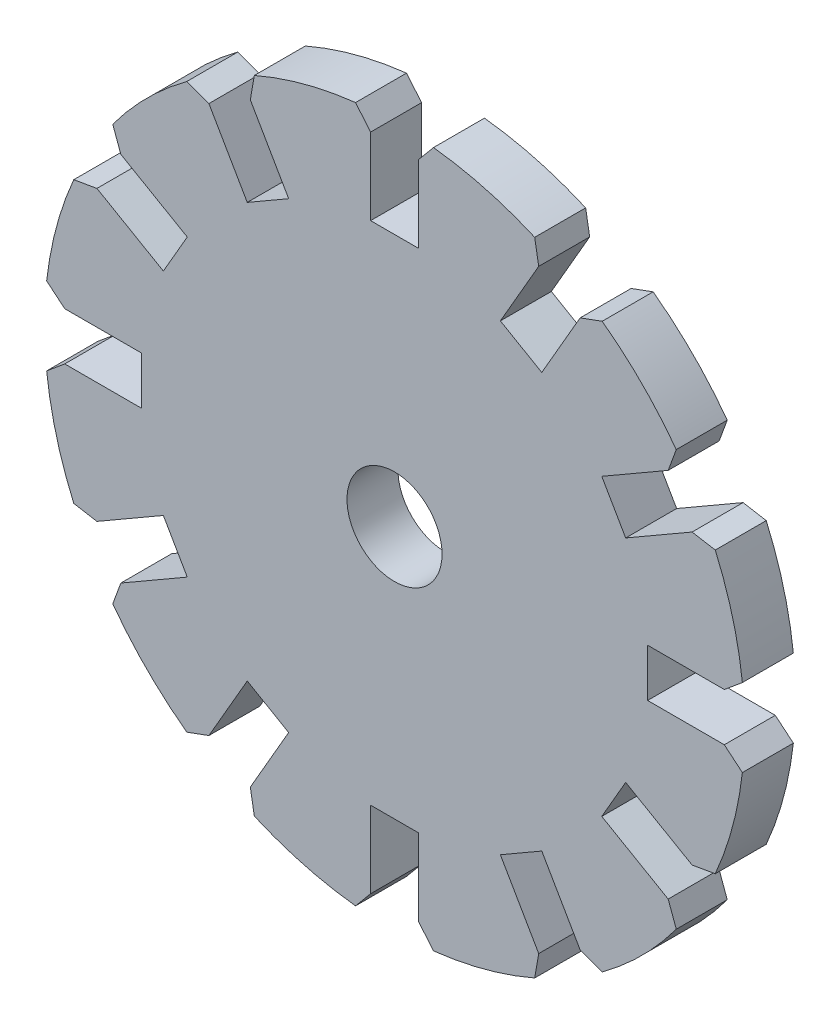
from build123d import *

# Parameters (mm, degrees)
ESQUISSE2_R        = 5
BOSS_EXTRU_1_DEPTH = 5.36


with BuildPart() as part:
    # Esquisse2 → Boss.-Extru.1 (new body)
    with BuildSketch(Plane.XY):
        with BuildLine():
            Line((-250.729190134, 145.16978197), (-253.049715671, 144.317485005))
            Line((-253.049715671, 144.317485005), (-257.082482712, 137.332527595))
            Line((-257.082482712, 137.332527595), (-261.438417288, 139.847427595))
            Line((-261.438417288, 139.847427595), (-257.405648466, 146.83238809))
            Line((-257.405648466, 146.83238809), (-257.827802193, 149.268167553))
            ThreePointArc((-257.827802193, 149.268167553), (-263.042097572, 151.09457672), (-268.471014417, 152.120007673))
            Line((-268.471014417, 152.120007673), (-270.0545, 150.221634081))
            Line((-270.0545, 150.221634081), (-270.0545, 142.1561))
            Line((-270.0545, 142.1561), (-275.0843, 142.1561))
            Line((-275.0843, 142.1561), (-275.0843, 150.221637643))
            Line((-275.0843, 150.221637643), (-276.667785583, 152.120007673))
            ThreePointArc((-276.667785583, 152.120007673), (-282.096702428, 151.09457672), (-287.310997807, 149.268167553))
            Line((-287.310997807, 149.268167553), (-287.733149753, 146.832385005))
            Line((-287.733149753, 146.832385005), (-283.700382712, 139.847427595))
            Line((-283.700382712, 139.847427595), (-288.056317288, 137.332527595))
            Line((-288.056317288, 137.332527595), (-292.08908611, 144.31748809))
            Line((-292.08908611, 144.31748809), (-294.409609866, 145.16978197))
            ThreePointArc((-294.409609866, 145.16978197), (-298.598474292, 141.567274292), (-302.20098197, 137.378409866))
            Line((-302.20098197, 137.378409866), (-301.348685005, 135.057884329))
            Line((-301.348685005, 135.057884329), (-294.363727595, 131.025117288))
            Line((-294.363727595, 131.025117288), (-296.878627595, 126.669182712))
            Line((-296.878627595, 126.669182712), (-303.86358809, 130.701951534))
            Line((-303.86358809, 130.701951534), (-306.299367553, 130.279797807))
            ThreePointArc((-306.299367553, 130.279797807), (-308.12577672, 125.065502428), (-309.151207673, 119.636585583))
            Line((-309.151207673, 119.636585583), (-307.252834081, 118.0531))
            Line((-307.252834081, 118.0531), (-299.1873, 118.0531))
            Line((-299.1873, 118.0531), (-299.1873, 113.0233))
            Line((-299.1873, 113.0233), (-307.252837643, 113.0233))
            Line((-307.252837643, 113.0233), (-309.151207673, 111.439814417))
            ThreePointArc((-309.151207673, 111.439814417), (-308.12577672, 106.010897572), (-306.299367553, 100.796602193))
            Line((-306.299367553, 100.796602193), (-303.863585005, 100.374450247))
            Line((-303.863585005, 100.374450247), (-296.878627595, 104.407217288))
            Line((-296.878627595, 104.407217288), (-294.363727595, 100.051282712))
            Line((-294.363727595, 100.051282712), (-301.34868809, 96.01851389))
            Line((-301.34868809, 96.01851389), (-302.20098197, 93.697990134))
            ThreePointArc((-302.20098197, 93.697990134), (-298.598474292, 89.509125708), (-294.409609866, 85.90661803))
            Line((-294.409609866, 85.90661803), (-292.089084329, 86.758914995))
            Line((-292.089084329, 86.758914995), (-288.056317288, 93.743872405))
            Line((-288.056317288, 93.743872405), (-283.700382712, 91.228972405))
            Line((-283.700382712, 91.228972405), (-287.733151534, 84.24401191))
            Line((-287.733151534, 84.24401191), (-287.310997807, 81.808232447))
            ThreePointArc((-287.310997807, 81.808232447), (-282.096702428, 79.98182328), (-276.667785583, 78.956392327))
            Line((-276.667785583, 78.956392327), (-275.0843, 80.854765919))
            Line((-275.0843, 80.854765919), (-275.0843, 88.9203))
            Line((-275.0843, 88.9203), (-270.0545, 88.9203))
            Line((-270.0545, 88.9203), (-270.0545, 80.854762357))
            Line((-270.0545, 80.854762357), (-268.471014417, 78.956392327))
            ThreePointArc((-268.471014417, 78.956392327), (-263.042097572, 79.98182328), (-257.827802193, 81.808232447))
            Line((-257.827802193, 81.808232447), (-257.405650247, 84.244014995))
            Line((-257.405650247, 84.244014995), (-261.438417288, 91.228972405))
            Line((-261.438417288, 91.228972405), (-257.082482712, 93.743872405))
            Line((-257.082482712, 93.743872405), (-253.04971389, 86.75891191))
            Line((-253.04971389, 86.75891191), (-250.729190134, 85.90661803))
            ThreePointArc((-250.729190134, 85.90661803), (-246.540325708, 89.509125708), (-242.93781803, 93.697990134))
            Line((-242.93781803, 93.697990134), (-243.790114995, 96.018515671))
            Line((-243.790114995, 96.018515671), (-250.775072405, 100.051282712))
            Line((-250.775072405, 100.051282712), (-248.260172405, 104.407217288))
            Line((-248.260172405, 104.407217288), (-241.27521191, 100.374448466))
            Line((-241.27521191, 100.374448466), (-238.839432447, 100.796602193))
            ThreePointArc((-238.839432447, 100.796602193), (-237.01302328, 106.010897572), (-235.987592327, 111.439814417))
            Line((-235.987592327, 111.439814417), (-237.885965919, 113.0233))
            Line((-237.885965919, 113.0233), (-245.9515, 113.0233))
            Line((-245.9515, 113.0233), (-245.9515, 118.0531))
            Line((-245.9515, 118.0531), (-237.885962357, 118.0531))
            Line((-237.885962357, 118.0531), (-235.987592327, 119.636585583))
            ThreePointArc((-235.987592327, 119.636585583), (-237.01302328, 125.065502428), (-238.839432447, 130.279797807))
            Line((-238.839432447, 130.279797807), (-241.275214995, 130.701949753))
            Line((-241.275214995, 130.701949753), (-248.260172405, 126.669182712))
            Line((-248.260172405, 126.669182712), (-250.775072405, 131.025117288))
            Line((-250.775072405, 131.025117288), (-243.79011191, 135.05788611))
            Line((-243.79011191, 135.05788611), (-242.93781803, 137.378409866))
            ThreePointArc((-242.93781803, 137.378409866), (-246.540325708, 141.567274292), (-250.729190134, 145.16978197))
        make_face()
        with Locations((-272.5694, 115.5382)):
            Circle(ESQUISSE2_R, mode=Mode.SUBTRACT)
    extrude(amount=BOSS_EXTRU_1_DEPTH)


solid = part.part
